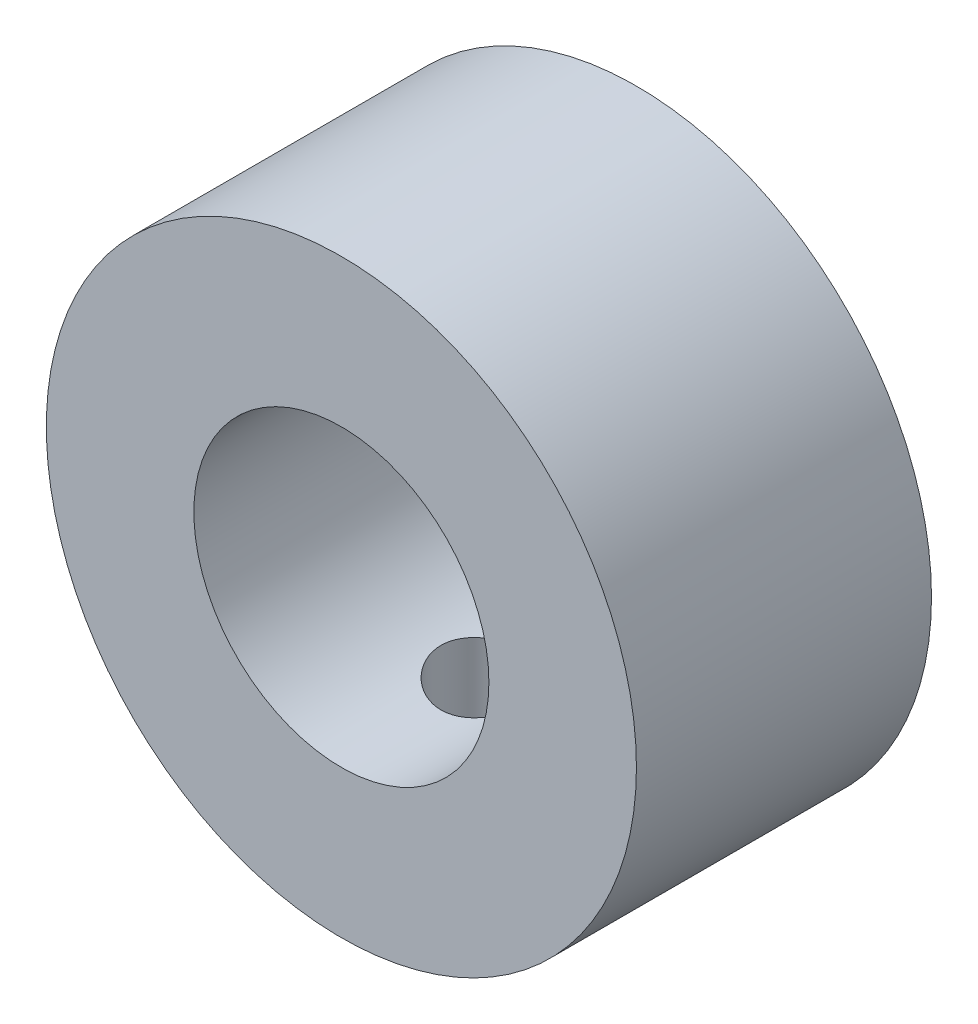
from build123d import *

# Parameters (mm, degrees)
ESQUISSE1_R             = 20
ESQUISSE1_R_2           = 10
BASE_EXTRUSION_DEPTH    = 20
ESQUISSE2_R             = 3.25
ENL_V_MAT_EXTRU_3_DEPTH = 25


with BuildPart() as part:
    # Esquisse1 → Base-Extrusion (new body)
    with BuildSketch(Plane.XY):
        Circle(ESQUISSE1_R)
        Circle(ESQUISSE1_R_2, mode=Mode.SUBTRACT)
    extrude(amount=BASE_EXTRUSION_DEPTH)

    # Esquisse2 → Enl_v. mat.-Extru.3 (cut)
    with BuildSketch(Plane(origin=(0, 0, 0), x_dir=(1, 0, 0), z_dir=(0, 1, 0))):
        with Locations(Location((0, -10, 0), (0, 0, 270))):
            Circle(ESQUISSE2_R)
    extrude(amount=-ENL_V_MAT_EXTRU_3_DEPTH, mode=Mode.SUBTRACT)


solid = part.part
